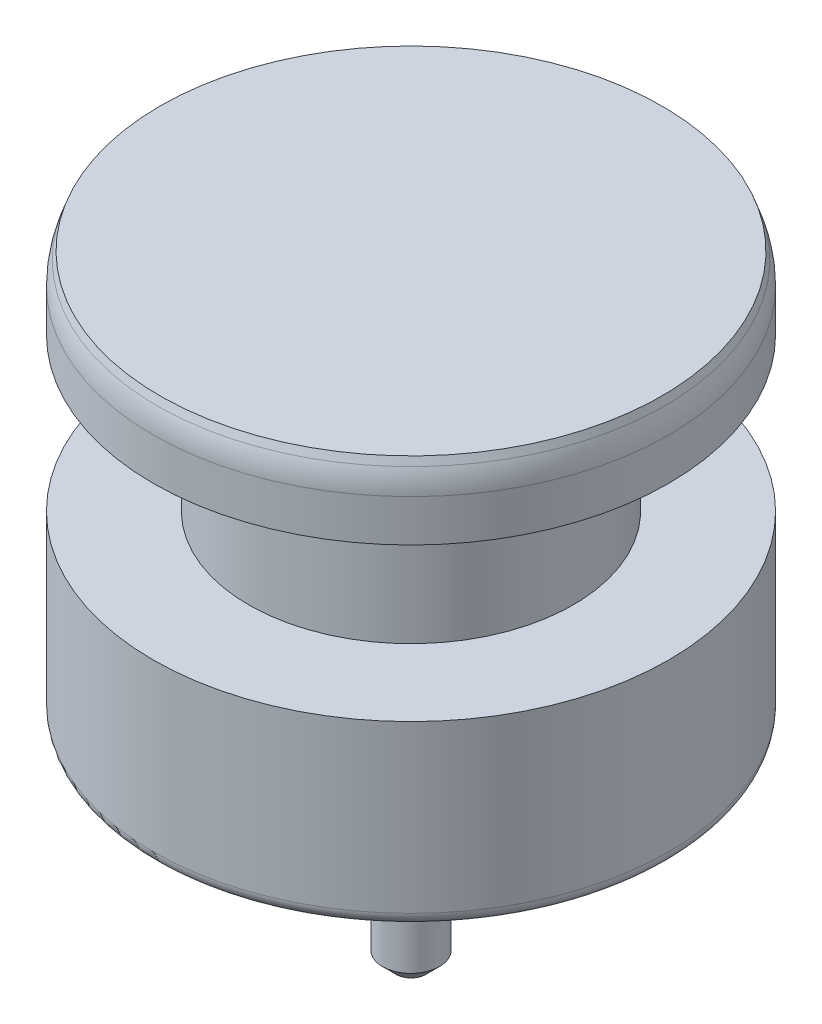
ISO-10303-21;
HEADER;
FILE_DESCRIPTION(('STEP AP214'),'2;1');
FILE_NAME('part.step','',(''),(''),'','','');
FILE_SCHEMA(('AUTOMOTIVE_DESIGN { 1 0 10303 214 1 1 1 1 }'));
ENDSEC;
DATA;
#1=APPLICATION_CONTEXT('core data for automotive mechanical design processes');
#2=APPLICATION_PROTOCOL_DEFINITION('international standard','automotive_design',2000,#1);
#3=PRODUCT_CONTEXT('',#1,'mechanical');
#4=PRODUCT('Part','Part','',(#3));
#5=PRODUCT_RELATED_PRODUCT_CATEGORY('part','',(#4));
#6=PRODUCT_DEFINITION_FORMATION('','',#4);
#7=PRODUCT_DEFINITION_CONTEXT('part definition',#1,'design');
#8=PRODUCT_DEFINITION('design','',#6,#7);
#9=PRODUCT_DEFINITION_SHAPE('','',#8);
#10=(LENGTH_UNIT() NAMED_UNIT(*) SI_UNIT(.MILLI.,.METRE.));
#11=(NAMED_UNIT(*) PLANE_ANGLE_UNIT() SI_UNIT($,.RADIAN.));
#12=(NAMED_UNIT(*) SI_UNIT($,.STERADIAN.) SOLID_ANGLE_UNIT());
#13=UNCERTAINTY_MEASURE_WITH_UNIT(LENGTH_MEASURE(1.E-05),#10,'distance_accuracy_value','');
#14=(GEOMETRIC_REPRESENTATION_CONTEXT(3) GLOBAL_UNCERTAINTY_ASSIGNED_CONTEXT((#13)) GLOBAL_UNIT_ASSIGNED_CONTEXT((#10,
#11,#12)) REPRESENTATION_CONTEXT('',''));
#15=CARTESIAN_POINT('',(0.,0.,0.));
#16=DIRECTION('',(0.,0.,1.));
#17=DIRECTION('',(1.,0.,0.));
#18=AXIS2_PLACEMENT_3D('',#15,#16,#17);
#19=CARTESIAN_POINT('',(3.71,0.,0.));
#20=DIRECTION('',(0.,-1.,0.));
#21=DIRECTION('',(1.,0.,0.));
#22=AXIS2_PLACEMENT_3D('',#19,#20,#21);
#23=PLANE('',#22);
#24=CARTESIAN_POINT('',(0.,0.,0.));
#25=DIRECTION('',(0.,1.,0.));
#26=DIRECTION('',(-1.,0.,0.));
#27=AXIS2_PLACEMENT_3D('',#24,#25,#26);
#28=CIRCLE('',#27,3.71);
#29=CARTESIAN_POINT('',(-3.71,0.,0.));
#30=VERTEX_POINT('',#29);
#31=EDGE_CURVE('E76',#30,#30,#28,.T.);
#32=ORIENTED_EDGE('',*,*,#31,.T.);
#33=EDGE_LOOP('',(#32));
#34=FACE_BOUND('',#33,.T.);
#35=ADVANCED_FACE('F35',(#34),#23,.F.);
#36=CARTESIAN_POINT('',(0.420000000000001,-9.15,0.));
#37=DIRECTION('',(0.,1.,0.));
#38=DIRECTION('',(-1.,0.,0.));
#39=AXIS2_PLACEMENT_3D('',#36,#37,#38);
#40=PLANE('',#39);
#41=CARTESIAN_POINT('',(0.,-9.15,0.));
#42=DIRECTION('',(0.,1.,0.));
#43=DIRECTION('',(-1.,0.,0.));
#44=AXIS2_PLACEMENT_3D('',#41,#42,#43);
#45=CIRCLE('',#44,0.219999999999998);
#46=CARTESIAN_POINT('',(-0.219999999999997,-9.15,0.));
#47=VERTEX_POINT('',#46);
#48=EDGE_CURVE('E10',#47,#47,#45,.F.);
#49=ORIENTED_EDGE('',*,*,#48,.T.);
#50=EDGE_LOOP('',(#49));
#51=FACE_BOUND('',#50,.T.);
#52=ADVANCED_FACE('F98',(#51),#40,.F.);
#53=CARTESIAN_POINT('',(0.,0.,0.));
#54=DIRECTION('',(0.,1.,0.));
#55=DIRECTION('',(-1.,0.,0.));
#56=AXIS2_PLACEMENT_3D('',#53,#54,#55);
#57=CYLINDRICAL_SURFACE('',#56,0.42);
#58=CARTESIAN_POINT('',(0.,-8.95,0.));
#59=DIRECTION('',(0.,1.,0.));
#60=DIRECTION('',(-1.,0.,0.));
#61=AXIS2_PLACEMENT_3D('',#58,#59,#60);
#62=CIRCLE('',#61,0.42);
#63=CARTESIAN_POINT('',(-0.419999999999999,-8.95,0.));
#64=VERTEX_POINT('',#63);
#65=EDGE_CURVE('E42',#64,#64,#62,.T.);
#66=ORIENTED_EDGE('',*,*,#65,.T.);
#67=EDGE_LOOP('',(#66));
#68=FACE_BOUND('',#67,.T.);
#69=CARTESIAN_POINT('',(0.,-7.85751288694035,0.));
#70=DIRECTION('',(0.,1.,0.));
#71=DIRECTION('',(-1.,0.,0.));
#72=AXIS2_PLACEMENT_3D('',#69,#70,#71);
#73=CIRCLE('',#72,0.42);
#74=CARTESIAN_POINT('',(-0.419999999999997,-7.85751288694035,0.));
#75=VERTEX_POINT('',#74);
#76=EDGE_CURVE('E61',#75,#75,#73,.T.);
#77=ORIENTED_EDGE('',*,*,#76,.F.);
#78=EDGE_LOOP('',(#77));
#79=FACE_BOUND('',#78,.T.);
#80=ADVANCED_FACE('F103',(#68,#79),#57,.T.);
#81=CARTESIAN_POINT('',(0.,-7.85751288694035,0.));
#82=DIRECTION('',(0.,1.,0.));
#83=DIRECTION('',(-1.,0.,0.));
#84=AXIS2_PLACEMENT_3D('',#81,#82,#83);
#85=CONICAL_SURFACE('',#84,0.42,1.04719755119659);
#86=CARTESIAN_POINT('',(0.,-5.95803050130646,0.));
#87=DIRECTION('',(0.,-1.,0.));
#88=DIRECTION('',(1.,0.,0.));
#89=AXIS2_PLACEMENT_3D('',#86,#87,#88);
#90=CIRCLE('',#89,3.71);
#91=CARTESIAN_POINT('',(-3.71,-5.95803050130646,0.));
#92=VERTEX_POINT('',#91);
#93=EDGE_CURVE('E55',#92,#92,#90,.T.);
#94=CARTESIAN_POINT('',(-3.71,-5.95803050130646,0.));
#95=CARTESIAN_POINT('',(-3.67572916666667,-5.97781677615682,0.));
#96=CARTESIAN_POINT('',(-3.64145833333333,-5.99760305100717,0.));
#97=CARTESIAN_POINT('',(-3.57291666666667,-6.03717560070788,0.));
#98=CARTESIAN_POINT('',(-3.53864583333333,-6.05696187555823,0.));
#99=CARTESIAN_POINT('',(-3.47010416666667,-6.09653442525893,0.));
#100=CARTESIAN_POINT('',(-3.43583333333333,-6.11632070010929,0.));
#101=CARTESIAN_POINT('',(-3.36729166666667,-6.15589324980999,0.));
#102=CARTESIAN_POINT('',(-3.33302083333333,-6.17567952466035,0.));
#103=CARTESIAN_POINT('',(-3.26447916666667,-6.21525207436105,0.));
#104=CARTESIAN_POINT('',(-3.23020833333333,-6.23503834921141,0.));
#105=CARTESIAN_POINT('',(-3.16166666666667,-6.27461089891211,0.));
#106=CARTESIAN_POINT('',(-3.12739583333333,-6.29439717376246,0.));
#107=CARTESIAN_POINT('',(-3.05885416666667,-6.33396972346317,0.));
#108=CARTESIAN_POINT('',(-3.02458333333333,-6.35375599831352,0.));
#109=CARTESIAN_POINT('',(-2.95604166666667,-6.39332854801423,0.));
#110=CARTESIAN_POINT('',(-2.92177083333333,-6.41311482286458,0.));
#111=CARTESIAN_POINT('',(-2.85322916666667,-6.45268737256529,0.));
#112=CARTESIAN_POINT('',(-2.81895833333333,-6.47247364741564,0.));
#113=CARTESIAN_POINT('',(-2.75041666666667,-6.51204619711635,0.));
#114=CARTESIAN_POINT('',(-2.71614583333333,-6.5318324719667,0.));
#115=CARTESIAN_POINT('',(-2.64760416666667,-6.57140502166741,0.));
#116=CARTESIAN_POINT('',(-2.61333333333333,-6.59119129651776,0.));
#117=CARTESIAN_POINT('',(-2.54479166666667,-6.63076384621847,0.));
#118=CARTESIAN_POINT('',(-2.51052083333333,-6.65055012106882,0.));
#119=CARTESIAN_POINT('',(-2.44197916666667,-6.69012267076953,0.));
#120=CARTESIAN_POINT('',(-2.40770833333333,-6.70990894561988,0.));
#121=CARTESIAN_POINT('',(-2.33916666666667,-6.74948149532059,0.));
#122=CARTESIAN_POINT('',(-2.30489583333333,-6.76926777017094,0.));
#123=CARTESIAN_POINT('',(-2.23635416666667,-6.80884031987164,0.));
#124=CARTESIAN_POINT('',(-2.20208333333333,-6.828626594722,0.));
#125=CARTESIAN_POINT('',(-2.13354166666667,-6.8681991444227,0.));
#126=CARTESIAN_POINT('',(-2.09927083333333,-6.88798541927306,0.));
#127=CARTESIAN_POINT('',(-2.03072916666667,-6.92755796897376,0.));
#128=CARTESIAN_POINT('',(-1.99645833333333,-6.94734424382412,0.));
#129=CARTESIAN_POINT('',(-1.92791666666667,-6.98691679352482,0.));
#130=CARTESIAN_POINT('',(-1.89364583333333,-7.00670306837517,0.));
#131=CARTESIAN_POINT('',(-1.82510416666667,-7.04627561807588,0.));
#132=CARTESIAN_POINT('',(-1.79083333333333,-7.06606189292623,0.));
#133=CARTESIAN_POINT('',(-1.72229166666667,-7.10563444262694,0.));
#134=CARTESIAN_POINT('',(-1.68802083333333,-7.12542071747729,0.));
#135=CARTESIAN_POINT('',(-1.61947916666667,-7.164993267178,0.));
#136=CARTESIAN_POINT('',(-1.58520833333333,-7.18477954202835,0.));
#137=CARTESIAN_POINT('',(-1.51666666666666,-7.22435209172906,0.));
#138=CARTESIAN_POINT('',(-1.48239583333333,-7.24413836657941,0.));
#139=CARTESIAN_POINT('',(-1.41385416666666,-7.28371091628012,0.));
#140=CARTESIAN_POINT('',(-1.37958333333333,-7.30349719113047,0.));
#141=CARTESIAN_POINT('',(-1.31104166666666,-7.34306974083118,0.));
#142=CARTESIAN_POINT('',(-1.27677083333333,-7.36285601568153,0.));
#143=CARTESIAN_POINT('',(-1.20822916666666,-7.40242856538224,0.));
#144=CARTESIAN_POINT('',(-1.17395833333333,-7.42221484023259,0.));
#145=CARTESIAN_POINT('',(-1.10541666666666,-7.46178738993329,0.));
#146=CARTESIAN_POINT('',(-1.07114583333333,-7.48157366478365,0.));
#147=CARTESIAN_POINT('',(-1.00260416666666,-7.52114621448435,0.));
#148=CARTESIAN_POINT('',(-0.968333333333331,-7.54093248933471,0.));
#149=CARTESIAN_POINT('',(-0.899791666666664,-7.58050503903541,0.));
#150=CARTESIAN_POINT('',(-0.865520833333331,-7.60029131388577,0.));
#151=CARTESIAN_POINT('',(-0.796979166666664,-7.63986386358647,0.));
#152=CARTESIAN_POINT('',(-0.762708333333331,-7.65965013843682,0.));
#153=CARTESIAN_POINT('',(-0.694166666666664,-7.69922268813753,0.));
#154=CARTESIAN_POINT('',(-0.659895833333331,-7.71900896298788,0.));
#155=CARTESIAN_POINT('',(-0.591354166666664,-7.75858151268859,0.));
#156=CARTESIAN_POINT('',(-0.557083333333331,-7.77836778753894,0.));
#157=CARTESIAN_POINT('',(-0.488541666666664,-7.81794033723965,0.));
#158=CARTESIAN_POINT('',(-0.454270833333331,-7.83772661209,0.));
#159=CARTESIAN_POINT('',(-0.419999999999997,-7.85751288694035,0.));
#160=B_SPLINE_CURVE_WITH_KNOTS('',3,(#94,#95,#96,#97,#98,#99,#100,#101,#102,#103,#104,#105,#106,
#107,#108,#109,#110,#111,#112,#113,#114,#115,#116,#117,#118,#119,#120,#121,#122,#123,#124,#125,
#126,#127,#128,#129,#130,#131,#132,#133,#134,#135,#136,#137,#138,#139,#140,#141,#142,#143,#144,
#145,#146,#147,#148,#149,#150,#151,#152,#153,#154,#155,#156,#157,#158,#159),.UNSPECIFIED.,.F.,
.F.,(4,2,2,2,2,2,2,2,2,2,2,2,2,2,2,2,2,2,2,2,2,2,2,2,2,2,2,2,2,2,2,2,4),(0.,0.118717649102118,
0.237435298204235,0.356152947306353,0.47487059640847,0.593588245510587,0.712305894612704,
0.831023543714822,0.949741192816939,1.06845884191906,1.18717649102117,1.30589414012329,
1.42461178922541,1.54332943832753,1.66204708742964,1.78076473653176,1.89948238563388,
2.01820003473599,2.13691768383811,2.25563533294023,2.37435298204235,2.49307063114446,
2.61178828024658,2.7305059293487,2.84922357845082,2.96794122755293,3.08665887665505,
3.20537652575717,3.32409417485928,3.4428118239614,3.56152947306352,3.68024712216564,
3.79896477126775),.UNSPECIFIED.);
#161=EDGE_CURVE('BSEAM137',#92,#75,#160,.T.);
#162=ORIENTED_EDGE('',*,*,#93,.T.);
#163=ORIENTED_EDGE('',*,*,#76,.T.);
#164=ORIENTED_EDGE('',*,*,#161,.T.);
#165=ORIENTED_EDGE('',*,*,#161,.F.);
#166=EDGE_LOOP('',(#162,#164,#163,#165));
#167=FACE_BOUND('',#166,.T.);
#168=ADVANCED_FACE('F137',(#167),#85,.T.);
#169=CARTESIAN_POINT('',(0.,0.,0.));
#170=DIRECTION('',(0.,1.,0.));
#171=DIRECTION('',(-1.,0.,0.));
#172=AXIS2_PLACEMENT_3D('',#169,#170,#171);
#173=CYLINDRICAL_SURFACE('',#172,3.81);
#174=CARTESIAN_POINT('',(0.,-5.78482542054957,0.));
#175=DIRECTION('',(0.,-1.,0.));
#176=DIRECTION('',(1.,0.,0.));
#177=AXIS2_PLACEMENT_3D('',#174,#175,#176);
#178=CIRCLE('',#177,3.81);
#179=CARTESIAN_POINT('',(3.81,-5.78482542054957,0.));
#180=VERTEX_POINT('',#179);
#181=EDGE_CURVE('E58',#180,#180,#178,.F.);
#182=ORIENTED_EDGE('',*,*,#181,.T.);
#183=EDGE_LOOP('',(#182));
#184=FACE_BOUND('',#183,.T.);
#185=CARTESIAN_POINT('',(0.,-3.33,0.));
#186=DIRECTION('',(0.,1.,0.));
#187=DIRECTION('',(-1.,0.,0.));
#188=AXIS2_PLACEMENT_3D('',#185,#186,#187);
#189=CIRCLE('',#188,3.81);
#190=CARTESIAN_POINT('',(-3.81,-3.33,0.));
#191=VERTEX_POINT('',#190);
#192=EDGE_CURVE('E64',#191,#191,#189,.T.);
#193=ORIENTED_EDGE('',*,*,#192,.F.);
#194=EDGE_LOOP('',(#193));
#195=FACE_BOUND('',#194,.T.);
#196=ADVANCED_FACE('F132',(#184,#195),#173,.T.);
#197=CARTESIAN_POINT('',(3.81,-3.33,0.));
#198=DIRECTION('',(0.,-1.,0.));
#199=DIRECTION('',(1.,0.,0.));
#200=AXIS2_PLACEMENT_3D('',#197,#198,#199);
#201=PLANE('',#200);
#202=CARTESIAN_POINT('',(0.,-3.33,0.));
#203=DIRECTION('',(0.,1.,0.));
#204=DIRECTION('',(-1.,0.,0.));
#205=AXIS2_PLACEMENT_3D('',#202,#203,#204);
#206=CIRCLE('',#205,2.4);
#207=CARTESIAN_POINT('',(-2.4,-3.33,0.));
#208=VERTEX_POINT('',#207);
#209=EDGE_CURVE('E67',#208,#208,#206,.T.);
#210=ORIENTED_EDGE('',*,*,#209,.F.);
#211=EDGE_LOOP('',(#210));
#212=FACE_BOUND('',#211,.T.);
#213=ORIENTED_EDGE('',*,*,#192,.T.);
#214=EDGE_LOOP('',(#213));
#215=FACE_BOUND('',#214,.T.);
#216=ADVANCED_FACE('F126',(#212,#215),#201,.F.);
#217=CARTESIAN_POINT('',(0.,0.,0.));
#218=DIRECTION('',(0.,1.,0.));
#219=DIRECTION('',(-1.,0.,0.));
#220=AXIS2_PLACEMENT_3D('',#217,#218,#219);
#221=CYLINDRICAL_SURFACE('',#220,2.4);
#222=CARTESIAN_POINT('',(0.,-1.07,0.));
#223=DIRECTION('',(0.,1.,0.));
#224=DIRECTION('',(-1.,0.,0.));
#225=AXIS2_PLACEMENT_3D('',#222,#223,#224);
#226=CIRCLE('',#225,2.4);
#227=CARTESIAN_POINT('',(-2.4,-1.07,0.));
#228=VERTEX_POINT('',#227);
#229=EDGE_CURVE('E70',#228,#228,#226,.T.);
#230=ORIENTED_EDGE('',*,*,#229,.F.);
#231=EDGE_LOOP('',(#230));
#232=FACE_BOUND('',#231,.T.);
#233=ORIENTED_EDGE('',*,*,#209,.T.);
#234=EDGE_LOOP('',(#233));
#235=FACE_BOUND('',#234,.T.);
#236=ADVANCED_FACE('F120',(#232,#235),#221,.T.);
#237=CARTESIAN_POINT('',(2.4,-1.07,0.));
#238=DIRECTION('',(0.,1.,0.));
#239=DIRECTION('',(-1.,0.,0.));
#240=AXIS2_PLACEMENT_3D('',#237,#238,#239);
#241=PLANE('',#240);
#242=CARTESIAN_POINT('',(0.,-1.07,0.));
#243=DIRECTION('',(0.,1.,0.));
#244=DIRECTION('',(-1.,0.,0.));
#245=AXIS2_PLACEMENT_3D('',#242,#243,#244);
#246=CIRCLE('',#245,3.81);
#247=CARTESIAN_POINT('',(-3.81,-1.07,0.));
#248=VERTEX_POINT('',#247);
#249=EDGE_CURVE('E73',#248,#248,#246,.T.);
#250=ORIENTED_EDGE('',*,*,#249,.F.);
#251=EDGE_LOOP('',(#250));
#252=FACE_BOUND('',#251,.T.);
#253=ORIENTED_EDGE('',*,*,#229,.T.);
#254=EDGE_LOOP('',(#253));
#255=FACE_BOUND('',#254,.T.);
#256=ADVANCED_FACE('F94',(#252,#255),#241,.F.);
#257=CARTESIAN_POINT('',(0.,0.,0.));
#258=DIRECTION('',(0.,1.,0.));
#259=DIRECTION('',(-1.,0.,0.));
#260=AXIS2_PLACEMENT_3D('',#257,#258,#259);
#261=CYLINDRICAL_SURFACE('',#260,3.81);
#262=CARTESIAN_POINT('',(0.,-0.451074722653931,0.));
#263=DIRECTION('',(0.,-1.,0.));
#264=DIRECTION('',(1.,0.,0.));
#265=AXIS2_PLACEMENT_3D('',#262,#263,#264);
#266=CIRCLE('',#265,3.81);
#267=CARTESIAN_POINT('',(3.81,-0.45107472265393,0.));
#268=VERTEX_POINT('',#267);
#269=EDGE_CURVE('E46',#268,#268,#266,.T.);
#270=ORIENTED_EDGE('',*,*,#269,.T.);
#271=EDGE_LOOP('',(#270));
#272=FACE_BOUND('',#271,.T.);
#273=ORIENTED_EDGE('',*,*,#249,.T.);
#274=EDGE_LOOP('',(#273));
#275=FACE_BOUND('',#274,.T.);
#276=ADVANCED_FACE('F84',(#272,#275),#261,.T.);
#277=CARTESIAN_POINT('',(0.,-0.274747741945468,0.));
#278=DIRECTION('',(0.,-1.,0.));
#279=DIRECTION('',(1.,0.,0.));
#280=AXIS2_PLACEMENT_3D('',#277,#278,#279);
#281=CONICAL_SURFACE('',#280,3.81,0.349065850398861);
#282=CARTESIAN_POINT('',(0.,-0.109054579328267,0.));
#283=DIRECTION('',(0.,1.,0.));
#284=DIRECTION('',(-1.,0.,0.));
#285=AXIS2_PLACEMENT_3D('',#282,#283,#284);
#286=CIRCLE('',#285,3.74969262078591);
#287=CARTESIAN_POINT('',(-3.74969262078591,-0.109054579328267,0.));
#288=VERTEX_POINT('',#287);
#289=EDGE_CURVE('E50',#288,#288,#286,.T.);
#290=ORIENTED_EDGE('',*,*,#289,.T.);
#291=EDGE_LOOP('',(#290));
#292=FACE_BOUND('',#291,.T.);
#293=ORIENTED_EDGE('',*,*,#31,.F.);
#294=EDGE_LOOP('',(#293));
#295=FACE_BOUND('',#294,.T.);
#296=ADVANCED_FACE('F81',(#292,#295),#281,.T.);
#297=CARTESIAN_POINT('',(0.,-5.78482542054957,0.));
#298=DIRECTION('',(0.,-1.,0.));
#299=DIRECTION('',(1.,0.,0.));
#300=AXIS2_PLACEMENT_3D('',#297,#298,#299);
#301=TOROIDAL_SURFACE('',#300,3.61,0.2);
#302=ORIENTED_EDGE('',*,*,#93,.F.);
#303=EDGE_LOOP('',(#302));
#304=FACE_BOUND('',#303,.T.);
#305=ORIENTED_EDGE('',*,*,#181,.F.);
#306=EDGE_LOOP('',(#305));
#307=FACE_BOUND('',#306,.T.);
#308=ADVANCED_FACE('F83',(#304,#307),#301,.T.);
#309=CARTESIAN_POINT('',(0.,-0.451074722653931,0.));
#310=DIRECTION('',(0.,-1.,0.));
#311=DIRECTION('',(1.,0.,0.));
#312=AXIS2_PLACEMENT_3D('',#309,#310,#311);
#313=TOROIDAL_SURFACE('',#312,2.81,1.);
#314=ORIENTED_EDGE('',*,*,#269,.F.);
#315=EDGE_LOOP('',(#314));
#316=FACE_BOUND('',#315,.T.);
#317=ORIENTED_EDGE('',*,*,#289,.F.);
#318=EDGE_LOOP('',(#317));
#319=FACE_BOUND('',#318,.T.);
#320=ADVANCED_FACE('F91',(#316,#319),#313,.T.);
#321=CARTESIAN_POINT('',(0.,-8.95,0.));
#322=DIRECTION('',(0.,1.,0.));
#323=DIRECTION('',(-1.,0.,0.));
#324=AXIS2_PLACEMENT_3D('',#321,#322,#323);
#325=CONICAL_SURFACE('',#324,0.42,0.785398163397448);
#326=ORIENTED_EDGE('',*,*,#48,.F.);
#327=EDGE_LOOP('',(#326));
#328=FACE_BOUND('',#327,.T.);
#329=ORIENTED_EDGE('',*,*,#65,.F.);
#330=EDGE_LOOP('',(#329));
#331=FACE_BOUND('',#330,.T.);
#332=ADVANCED_FACE('F37',(#328,#331),#325,.T.);
#333=CLOSED_SHELL('',(#35,#52,#80,#168,#196,#216,#236,#256,#276,#296,#308,#320,#332));
#334=MANIFOLD_SOLID_BREP('B2',#333);
#335=ADVANCED_BREP_SHAPE_REPRESENTATION('',(#18,#334),#14);
#336=SHAPE_DEFINITION_REPRESENTATION(#9,#335);
ENDSEC;
END-ISO-10303-21;
